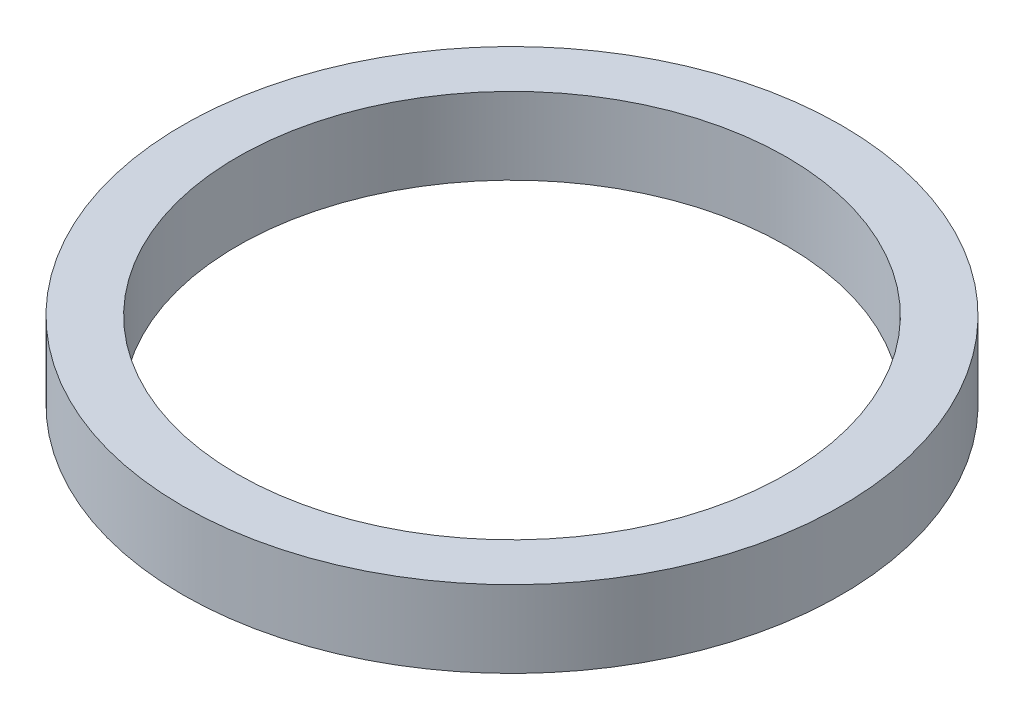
from build123d import *

# Parameters (mm, degrees)
SKETCH1_R           = 15
BOSS_EXTRUDE1_DEPTH = 3.5
SKETCH2_R           = 12.5
CUT_EXTRUDE1_DEPTH  = 3.5


with BuildPart() as part:
    # Sketch1 → Boss-Extrude1 (new body)
    with BuildSketch(Plane(origin=(0, 0, 0), x_dir=(1, 0, 0), z_dir=(0, 1, 0))):
        with Locations(Location((0, 0, 0), (0, 0, 270))):
            Circle(SKETCH1_R)
    extrude(amount=BOSS_EXTRUDE1_DEPTH)

    # Sketch2 → Cut-Extrude1 (cut)
    with BuildSketch(Plane(origin=(0, 3.5, 0), x_dir=(1, 0, 0), z_dir=(0, 1, 0))):
        with Locations(Location((0, 0, 0), (0, 0, 270))):
            Circle(SKETCH2_R)
    extrude(amount=-CUT_EXTRUDE1_DEPTH, mode=Mode.SUBTRACT)


solid = part.part
